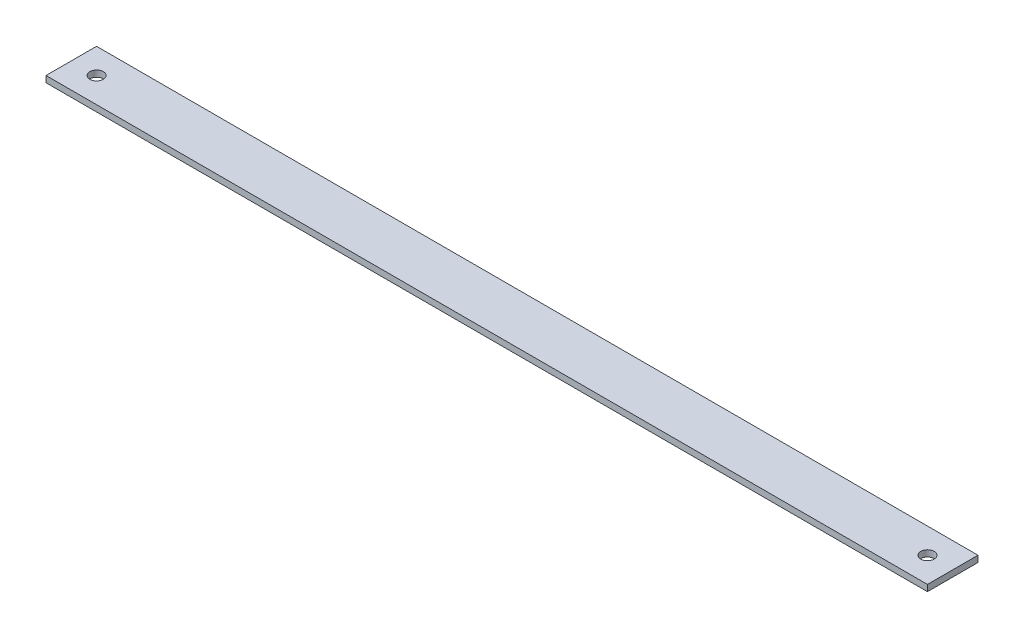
ISO-10303-21;
HEADER;
FILE_DESCRIPTION(('STEP AP214'),'2;1');
FILE_NAME('part.step','',(''),(''),'','','');
FILE_SCHEMA(('AUTOMOTIVE_DESIGN { 1 0 10303 214 1 1 1 1 }'));
ENDSEC;
DATA;
#1=APPLICATION_CONTEXT('core data for automotive mechanical design processes');
#2=APPLICATION_PROTOCOL_DEFINITION('international standard','automotive_design',2000,#1);
#3=PRODUCT_CONTEXT('',#1,'mechanical');
#4=PRODUCT('Part','Part','',(#3));
#5=PRODUCT_RELATED_PRODUCT_CATEGORY('part','',(#4));
#6=PRODUCT_DEFINITION_FORMATION('','',#4);
#7=PRODUCT_DEFINITION_CONTEXT('part definition',#1,'design');
#8=PRODUCT_DEFINITION('design','',#6,#7);
#9=PRODUCT_DEFINITION_SHAPE('','',#8);
#10=(LENGTH_UNIT() NAMED_UNIT(*) SI_UNIT(.MILLI.,.METRE.));
#11=(NAMED_UNIT(*) PLANE_ANGLE_UNIT() SI_UNIT($,.RADIAN.));
#12=(NAMED_UNIT(*) SI_UNIT($,.STERADIAN.) SOLID_ANGLE_UNIT());
#13=UNCERTAINTY_MEASURE_WITH_UNIT(LENGTH_MEASURE(1.E-05),#10,'distance_accuracy_value','');
#14=(GEOMETRIC_REPRESENTATION_CONTEXT(3) GLOBAL_UNCERTAINTY_ASSIGNED_CONTEXT((#13)) GLOBAL_UNIT_ASSIGNED_CONTEXT((#10,
#11,#12)) REPRESENTATION_CONTEXT('',''));
#15=CARTESIAN_POINT('',(0.,0.,0.));
#16=DIRECTION('',(0.,0.,1.));
#17=DIRECTION('',(1.,0.,0.));
#18=AXIS2_PLACEMENT_3D('',#15,#16,#17);
#19=CARTESIAN_POINT('',(221.488,3.175,-12.7));
#20=DIRECTION('',(-1.,0.,0.));
#21=DIRECTION('',(0.,0.,1.));
#22=AXIS2_PLACEMENT_3D('',#19,#20,#21);
#23=PLANE('',#22);
#24=DIRECTION('',(0.,0.,-1.));
#25=VECTOR('',#24,1.);
#26=CARTESIAN_POINT('',(221.488,0.,-12.7));
#27=LINE('',#26,#25);
#28=CARTESIAN_POINT('',(221.488,0.,12.7));
#29=VERTEX_POINT('',#28);
#30=CARTESIAN_POINT('',(221.488,0.,-12.7));
#31=VERTEX_POINT('',#30);
#32=EDGE_CURVE('E97',#29,#31,#27,.T.);
#33=ORIENTED_EDGE('',*,*,#32,.T.);
#34=DIRECTION('',(0.,-1.,0.));
#35=VECTOR('',#34,1.);
#36=CARTESIAN_POINT('',(221.488,3.175,-12.7));
#37=LINE('',#36,#35);
#38=CARTESIAN_POINT('',(221.488,3.175,-12.7));
#39=VERTEX_POINT('',#38);
#40=EDGE_CURVE('E11',#39,#31,#37,.T.);
#41=ORIENTED_EDGE('',*,*,#40,.F.);
#42=DIRECTION('',(0.,0.,-1.));
#43=VECTOR('',#42,1.);
#44=CARTESIAN_POINT('',(221.488,3.175,-12.7));
#45=LINE('',#44,#43);
#46=CARTESIAN_POINT('',(221.488,3.175,12.7));
#47=VERTEX_POINT('',#46);
#48=EDGE_CURVE('E85',#47,#39,#45,.T.);
#49=ORIENTED_EDGE('',*,*,#48,.F.);
#50=DIRECTION('',(0.,-1.,0.));
#51=VECTOR('',#50,1.);
#52=CARTESIAN_POINT('',(221.488,3.175,12.7));
#53=LINE('',#52,#51);
#54=EDGE_CURVE('E93',#47,#29,#53,.T.);
#55=ORIENTED_EDGE('',*,*,#54,.T.);
#56=EDGE_LOOP('',(#33,#41,#49,#55));
#57=FACE_BOUND('',#56,.T.);
#58=ADVANCED_FACE('F34',(#57),#23,.F.);
#59=CARTESIAN_POINT('',(-221.488,3.175,-12.7));
#60=DIRECTION('',(0.,0.,1.));
#61=DIRECTION('',(1.,0.,0.));
#62=AXIS2_PLACEMENT_3D('',#59,#60,#61);
#63=PLANE('',#62);
#64=DIRECTION('',(-1.,0.,0.));
#65=VECTOR('',#64,1.);
#66=CARTESIAN_POINT('',(-221.488,0.,-12.7));
#67=LINE('',#66,#65);
#68=CARTESIAN_POINT('',(-221.488,0.,-12.7));
#69=VERTEX_POINT('',#68);
#70=EDGE_CURVE('E89',#31,#69,#67,.T.);
#71=ORIENTED_EDGE('',*,*,#70,.T.);
#72=DIRECTION('',(0.,-1.,0.));
#73=VECTOR('',#72,1.);
#74=CARTESIAN_POINT('',(-221.488,3.175,-12.7));
#75=LINE('',#74,#73);
#76=CARTESIAN_POINT('',(-221.488,3.175,-12.7));
#77=VERTEX_POINT('',#76);
#78=EDGE_CURVE('E42',#77,#69,#75,.T.);
#79=ORIENTED_EDGE('',*,*,#78,.F.);
#80=DIRECTION('',(-1.,0.,0.));
#81=VECTOR('',#80,1.);
#82=CARTESIAN_POINT('',(-221.488,3.175,-12.7));
#83=LINE('',#82,#81);
#84=EDGE_CURVE('E80',#39,#77,#83,.T.);
#85=ORIENTED_EDGE('',*,*,#84,.F.);
#86=ORIENTED_EDGE('',*,*,#40,.T.);
#87=EDGE_LOOP('',(#71,#79,#85,#86));
#88=FACE_BOUND('',#87,.T.);
#89=ADVANCED_FACE('F88',(#88),#63,.F.);
#90=CARTESIAN_POINT('',(-221.488,3.175,-12.7));
#91=DIRECTION('',(1.,0.,0.));
#92=DIRECTION('',(0.,0.,-1.));
#93=AXIS2_PLACEMENT_3D('',#90,#91,#92);
#94=PLANE('',#93);
#95=DIRECTION('',(0.,0.,1.));
#96=VECTOR('',#95,1.);
#97=CARTESIAN_POINT('',(-221.488,0.,-12.7));
#98=LINE('',#97,#96);
#99=CARTESIAN_POINT('',(-221.488,0.,12.7));
#100=VERTEX_POINT('',#99);
#101=EDGE_CURVE('E67',#69,#100,#98,.T.);
#102=ORIENTED_EDGE('',*,*,#101,.T.);
#103=DIRECTION('',(0.,-1.,0.));
#104=VECTOR('',#103,1.);
#105=CARTESIAN_POINT('',(-221.488,3.175,12.7));
#106=LINE('',#105,#104);
#107=CARTESIAN_POINT('',(-221.488,3.175,12.7));
#108=VERTEX_POINT('',#107);
#109=EDGE_CURVE('E90',#108,#100,#106,.T.);
#110=ORIENTED_EDGE('',*,*,#109,.F.);
#111=DIRECTION('',(0.,0.,1.));
#112=VECTOR('',#111,1.);
#113=CARTESIAN_POINT('',(-221.488,3.175,-12.7));
#114=LINE('',#113,#112);
#115=EDGE_CURVE('E83',#77,#108,#114,.T.);
#116=ORIENTED_EDGE('',*,*,#115,.F.);
#117=ORIENTED_EDGE('',*,*,#78,.T.);
#118=EDGE_LOOP('',(#102,#110,#116,#117));
#119=FACE_BOUND('',#118,.T.);
#120=ADVANCED_FACE('F91',(#119),#94,.F.);
#121=CARTESIAN_POINT('',(-221.488,3.175,12.7));
#122=DIRECTION('',(0.,0.,-1.));
#123=DIRECTION('',(-1.,0.,0.));
#124=AXIS2_PLACEMENT_3D('',#121,#122,#123);
#125=PLANE('',#124);
#126=DIRECTION('',(1.,0.,0.));
#127=VECTOR('',#126,1.);
#128=CARTESIAN_POINT('',(-221.488,0.,12.7));
#129=LINE('',#128,#127);
#130=EDGE_CURVE('E73',#100,#29,#129,.T.);
#131=ORIENTED_EDGE('',*,*,#130,.T.);
#132=ORIENTED_EDGE('',*,*,#54,.F.);
#133=DIRECTION('',(1.,0.,0.));
#134=VECTOR('',#133,1.);
#135=CARTESIAN_POINT('',(-221.488,3.175,12.7));
#136=LINE('',#135,#134);
#137=EDGE_CURVE('E50',#108,#47,#136,.T.);
#138=ORIENTED_EDGE('',*,*,#137,.F.);
#139=ORIENTED_EDGE('',*,*,#109,.T.);
#140=EDGE_LOOP('',(#131,#132,#138,#139));
#141=FACE_BOUND('',#140,.T.);
#142=ADVANCED_FACE('F105',(#141),#125,.F.);
#143=CARTESIAN_POINT('',(221.488,3.175,12.7));
#144=DIRECTION('',(0.,1.,0.));
#145=DIRECTION('',(0.,0.,1.));
#146=AXIS2_PLACEMENT_3D('',#143,#144,#145);
#147=PLANE('',#146);
#148=CARTESIAN_POINT('',(208.788,3.175,0.));
#149=DIRECTION('',(0.,1.,0.));
#150=DIRECTION('',(0.,0.,1.));
#151=AXIS2_PLACEMENT_3D('',#148,#149,#150);
#152=CIRCLE('',#151,3.37819999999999);
#153=CARTESIAN_POINT('',(208.788,3.175,3.37819999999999));
#154=VERTEX_POINT('',#153);
#155=EDGE_CURVE('E117',#154,#154,#152,.T.);
#156=ORIENTED_EDGE('',*,*,#155,.F.);
#157=EDGE_LOOP('',(#156));
#158=FACE_BOUND('',#157,.T.);
#159=CARTESIAN_POINT('',(-208.788,3.175,0.));
#160=DIRECTION('',(0.,1.,0.));
#161=DIRECTION('',(0.,0.,1.));
#162=AXIS2_PLACEMENT_3D('',#159,#160,#161);
#163=CIRCLE('',#162,3.37819999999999);
#164=CARTESIAN_POINT('',(-208.788,3.175,3.37819999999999));
#165=VERTEX_POINT('',#164);
#166=EDGE_CURVE('E111',#165,#165,#163,.T.);
#167=ORIENTED_EDGE('',*,*,#166,.F.);
#168=EDGE_LOOP('',(#167));
#169=FACE_BOUND('',#168,.T.);
#170=ORIENTED_EDGE('',*,*,#48,.T.);
#171=ORIENTED_EDGE('',*,*,#84,.T.);
#172=ORIENTED_EDGE('',*,*,#115,.T.);
#173=ORIENTED_EDGE('',*,*,#137,.T.);
#174=EDGE_LOOP('',(#170,#171,#172,#173));
#175=FACE_BOUND('',#174,.T.);
#176=ADVANCED_FACE('F81',(#158,#169,#175),#147,.T.);
#177=CARTESIAN_POINT('',(221.488,0.,12.7));
#178=DIRECTION('',(0.,1.,0.));
#179=DIRECTION('',(0.,0.,1.));
#180=AXIS2_PLACEMENT_3D('',#177,#178,#179);
#181=PLANE('',#180);
#182=CARTESIAN_POINT('',(208.788,0.,0.));
#183=DIRECTION('',(0.,1.,0.));
#184=DIRECTION('',(0.,0.,1.));
#185=AXIS2_PLACEMENT_3D('',#182,#183,#184);
#186=CIRCLE('',#185,3.37819999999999);
#187=CARTESIAN_POINT('',(208.788,0.,3.37819999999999));
#188=VERTEX_POINT('',#187);
#189=EDGE_CURVE('E114',#188,#188,#186,.T.);
#190=ORIENTED_EDGE('',*,*,#189,.T.);
#191=EDGE_LOOP('',(#190));
#192=FACE_BOUND('',#191,.T.);
#193=CARTESIAN_POINT('',(-208.788,0.,0.));
#194=DIRECTION('',(0.,1.,0.));
#195=DIRECTION('',(0.,0.,1.));
#196=AXIS2_PLACEMENT_3D('',#193,#194,#195);
#197=CIRCLE('',#196,3.37819999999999);
#198=CARTESIAN_POINT('',(-208.788,0.,3.37819999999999));
#199=VERTEX_POINT('',#198);
#200=EDGE_CURVE('E100',#199,#199,#197,.T.);
#201=ORIENTED_EDGE('',*,*,#200,.T.);
#202=EDGE_LOOP('',(#201));
#203=FACE_BOUND('',#202,.T.);
#204=ORIENTED_EDGE('',*,*,#32,.F.);
#205=ORIENTED_EDGE('',*,*,#130,.F.);
#206=ORIENTED_EDGE('',*,*,#101,.F.);
#207=ORIENTED_EDGE('',*,*,#70,.F.);
#208=EDGE_LOOP('',(#204,#205,#206,#207));
#209=FACE_BOUND('',#208,.T.);
#210=ADVANCED_FACE('F108',(#192,#203,#209),#181,.F.);
#211=CARTESIAN_POINT('',(-208.788,0.,0.));
#212=DIRECTION('',(0.,1.,0.));
#213=DIRECTION('',(0.,0.,1.));
#214=AXIS2_PLACEMENT_3D('',#211,#212,#213);
#215=CYLINDRICAL_SURFACE('',#214,3.37819999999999);
#216=ORIENTED_EDGE('',*,*,#200,.F.);
#217=EDGE_LOOP('',(#216));
#218=FACE_BOUND('',#217,.T.);
#219=ORIENTED_EDGE('',*,*,#166,.T.);
#220=EDGE_LOOP('',(#219));
#221=FACE_BOUND('',#220,.T.);
#222=ADVANCED_FACE('F128',(#218,#221),#215,.F.);
#223=CARTESIAN_POINT('',(208.788,0.,0.));
#224=DIRECTION('',(0.,1.,0.));
#225=DIRECTION('',(0.,0.,1.));
#226=AXIS2_PLACEMENT_3D('',#223,#224,#225);
#227=CYLINDRICAL_SURFACE('',#226,3.37819999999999);
#228=ORIENTED_EDGE('',*,*,#189,.F.);
#229=EDGE_LOOP('',(#228));
#230=FACE_BOUND('',#229,.T.);
#231=ORIENTED_EDGE('',*,*,#155,.T.);
#232=EDGE_LOOP('',(#231));
#233=FACE_BOUND('',#232,.T.);
#234=ADVANCED_FACE('F125',(#230,#233),#227,.F.);
#235=CLOSED_SHELL('',(#58,#89,#120,#142,#176,#210,#222,#234));
#236=MANIFOLD_SOLID_BREP('B2',#235);
#237=ADVANCED_BREP_SHAPE_REPRESENTATION('',(#18,#236),#14);
#238=SHAPE_DEFINITION_REPRESENTATION(#9,#237);
ENDSEC;
END-ISO-10303-21;
